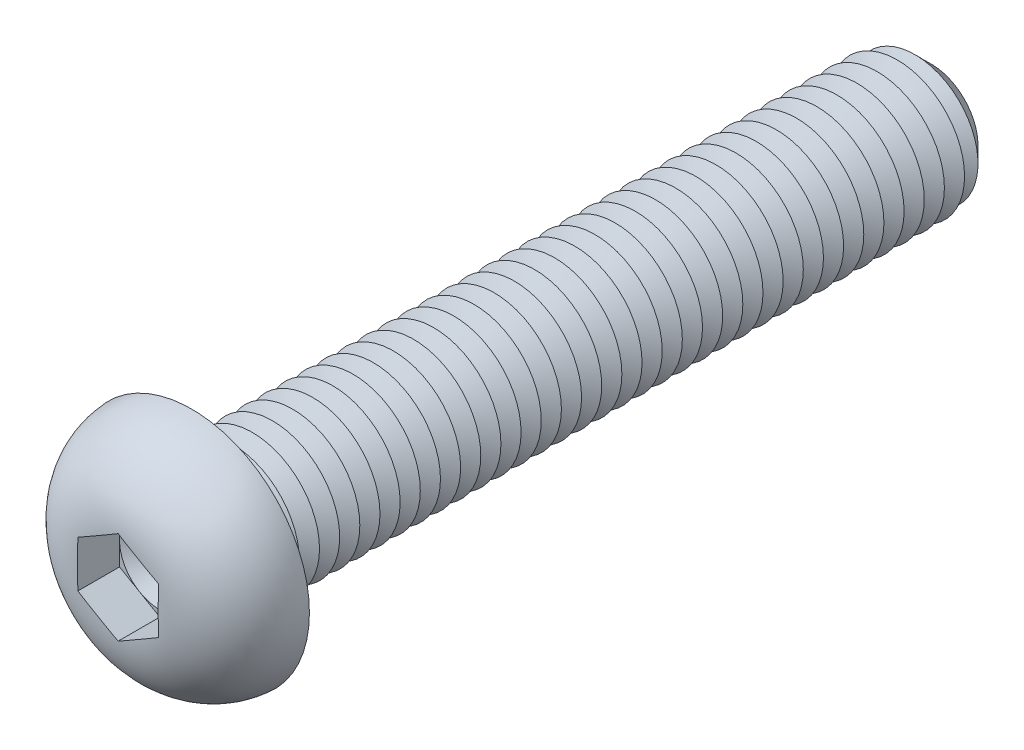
from build123d import *

# Parameters (mm, degrees)
CUT_EXTRUDE1_DEPTH  = 3.12
SKETCH4_R           = 5
BOSS_EXTRUDE1_DEPTH = 55
CHAMFER1_SIZE       = 1.5
LPATTERN1_COUNT     = 35
LPATTERN1_PITCH     = 1.5
FILLET2_R           = 0.6


with BuildPart() as part:
    # Sketch2 → Revolve1 (revolve)
    with BuildSketch(Plane(origin=(0, 0, 0), x_dir=(0, 0, -1), z_dir=(1, 0, 0)), mode=Mode.PRIVATE) as revolve1_sk:
        with BuildLine():
            Line((0, 0), (-5.5, 0))
            Line((-5.5, 0), (-5.5, 2.957763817))
            ThreePointArc((-5.5, 2.957763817), (-3.905948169, 6.951508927), (0, 8.75))
            Line((0, 8.75), (0, 0))
        make_face()
    revolve(revolve1_sk.sketch.rotate(Axis((0, 0, 47.934239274), (0, 0, -1)), 90), axis=Axis((0, 0, 47.934239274), (0, 0, -1)))

    # Sketch3 → Cut-Extrude1 (cut)
    with BuildSketch(Plane.XY.offset(5.5)):
        Polygon((0, 3.464101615), (-3, 1.732050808), (-3, -1.732050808), (0, -3.464101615), (3, -1.732050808), (3, 1.732050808), align=None)
    extrude(amount=-CUT_EXTRUDE1_DEPTH, mode=Mode.SUBTRACT)

    # Sketch4 → Boss-Extrude1 (add)
    with BuildSketch(Plane(origin=(0, 0, 0), x_dir=(-1, 0, 0), z_dir=(0, 0, -1))):
        with Locations(Location((0, 0, 0), (0, 0, 180))):
            Circle(SKETCH4_R)
    extrude(amount=BOSS_EXTRUDE1_DEPTH)

    # Chamfer1
    chamfer1_edges = [part.edges().sort_by_distance(p)[0] for p in [
        (-5, 0, -55),
    ]]
    chamfer(chamfer1_edges, length=CHAMFER1_SIZE)

    # Sketch5 → Cut-Revolve1 (revolve, cut)
    with BuildSketch(Plane(origin=(0, 0, 0), x_dir=(0, 0, -1), z_dir=(1, 0, 0)), mode=Mode.PRIVATE) as cut_revolve1_sk:
        Polygon((1.5, 5), (3, 5), (2.25, 3.700961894), align=None)
    cut_revolve1 = revolve(cut_revolve1_sk.sketch.rotate(Axis((0, 0, 47.934239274), (0, 0, -1)), 90), axis=Axis((0, 0, 47.934239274), (0, 0, -1)), mode=Mode.SUBTRACT)

    # LPattern1: Cut-Revolve1 ×35
    with Locations(*[(0, 0, -i * LPATTERN1_PITCH) for i in range(1, LPATTERN1_COUNT)]):
        add(cut_revolve1, mode=Mode.SUBTRACT)

    # Fillet2
    fillet2_edges = [part.edges().sort_by_distance(p)[0] for p in [
        (-5, 0, 0),
    ]]
    fillet(fillet2_edges, radius=FILLET2_R)

    # Cut-Extrude2 cone 1 section (on through the dimple's axis) → Cut-Extrude2 (revolve, cut)
    with BuildSketch(Plane(origin=(0, 0, 2.38), x_dir=(0, -1, 0), z_dir=(1, 0, 0))):
        Polygon((0, 0), (3, 0), (0, 1.732050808), align=None)
    revolve(axis=Axis((0, 0, 2.38), (0, 0, -1)), mode=Mode.SUBTRACT)


solid = part.part
